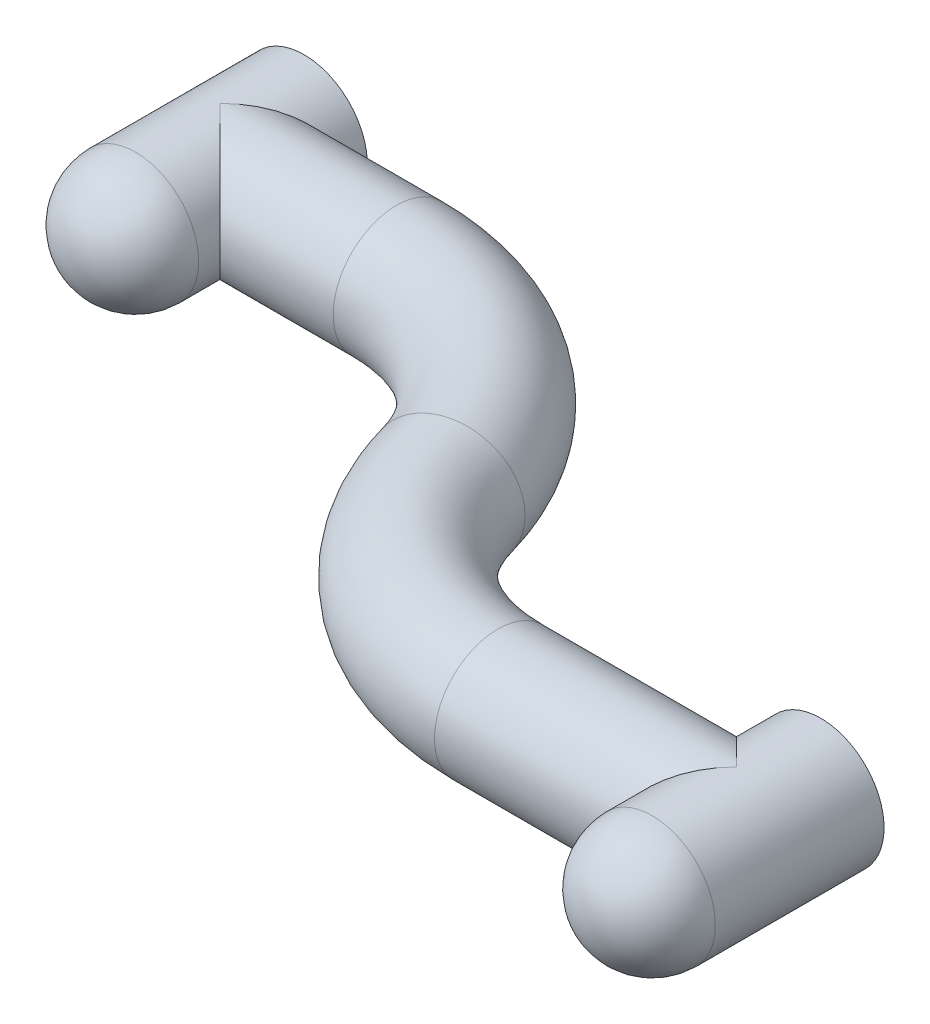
from build123d import *

# Parameters (mm, degrees)
ESQUISSE2_R             = 30
ESQUISSE2_R_2           = 27
ESQUISSE3_W             = 30
ESQUISSE3_H             = 80
ESQUISSE4_W             = 30
ESQUISSE4_H             = 80
ESQUISSE5_R             = 27
ENL_V_MAT_EXTRU_1_DEPTH = 485.174555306


with BuildPart() as part:
    # Balayage1: sweep along a path in Esquisse1
    with BuildLine(Plane(origin=(0, 0, 0), x_dir=(1, 0, 0), z_dir=(0, 1, 0))) as balayage1_path:
        Line((0, 0), (-113.203482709, 0))
        ThreePointArc((-113.203482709, 0), (-175.308220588, 20.866700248), (-212.213552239, 75))
        ThreePointArc((-212.213552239, 75), (-249.11888389, 129.133299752), (-311.223621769, 150))
        Line((-311.223621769, 150), (-395, 150))
    # Esquisse2 → Balayage1 (sweep)
    with BuildSketch(Plane(origin=(0, 0, 0), x_dir=(0, 0, -1), z_dir=(1, 0, 0))):
        Circle(ESQUISSE2_R)
        Circle(ESQUISSE2_R_2, mode=Mode.SUBTRACT)
    sweep(path=balayage1_path.line)

    # Esquisse3 → R_volution1 (revolve)
    with BuildSketch(Plane(origin=(0, 0, 0), x_dir=(1, 0, 0), z_dir=(0, 1, 0)), mode=Mode.PRIVATE) as r_volution1_sk:
        with Locations((15, 0)):
            Rectangle(ESQUISSE3_W, ESQUISSE3_H)
    revolve(r_volution1_sk.sketch.rotate(Axis((0, 0, -40), (0, 0, 1)), 180), axis=Axis((0, 0, -40), (0, 0, 1)))

    # Esquisse4 → R_volution2 (revolve)
    with BuildSketch(Plane(origin=(0, 0, 0), x_dir=(1, 0, 0), z_dir=(0, 1, 0))):
        with Locations((-410, 150)):
            Rectangle(ESQUISSE4_W, ESQUISSE4_H)
    revolve(axis=Axis((-395, 0, -190), (0, 0, 1)))

    # Esquisse5 → Enl_v. mat.-Extru.1 (cut, through all)
    with BuildSketch(Plane.XY.offset(40)):
        Circle(ESQUISSE5_R)
        with Locations((-395, 0)):
            Circle(ESQUISSE5_R)
    extrude(amount=-ENL_V_MAT_EXTRU_1_DEPTH, mode=Mode.SUBTRACT)

    # Esquisse6 → R_volution3 (revolve)
    with BuildSketch(Plane(origin=(0, 0, 0), x_dir=(1, 0, 0), z_dir=(0, 1, 0))):
        with BuildLine():
            Line((-30, -40), (0, -40))
            Line((0, -40), (0, -70))
            ThreePointArc((0, -70), (-21.213203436, -61.213203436), (-30, -40))
        make_face()
    revolve(axis=Axis((0, 0, 40), (0, 0, 1)))

    # Esquisse7 → R_volution4 (revolve)
    with BuildSketch(Plane(origin=(0, 0, 0), x_dir=(1, 0, 0), z_dir=(0, 1, 0))):
        with BuildLine():
            Line((-425, 110), (-395, 110))
            Line((-395, 110), (-395, 80))
            ThreePointArc((-395, 80), (-416.213203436, 88.786796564), (-425, 110))
        make_face()
    revolve(axis=Axis((-395, 0, -110), (0, 0, 1)))


solid = part.part
